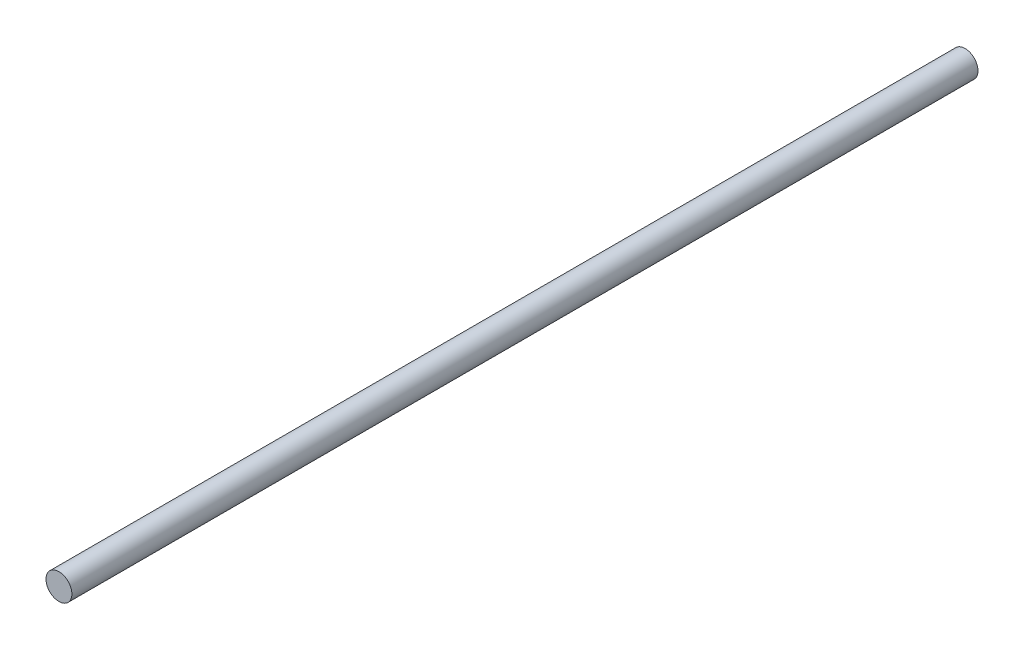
from build123d import *

# Parameters (mm, degrees)
SKETCH1_R           = 30
BOSS_EXTRUDE1_DEPTH = 2100


with BuildPart() as part:
    # Sketch1 → Boss-Extrude1 (new body)
    with BuildSketch(Plane.XY):
        Circle(SKETCH1_R)
    extrude(amount=-BOSS_EXTRUDE1_DEPTH)


solid = part.part
